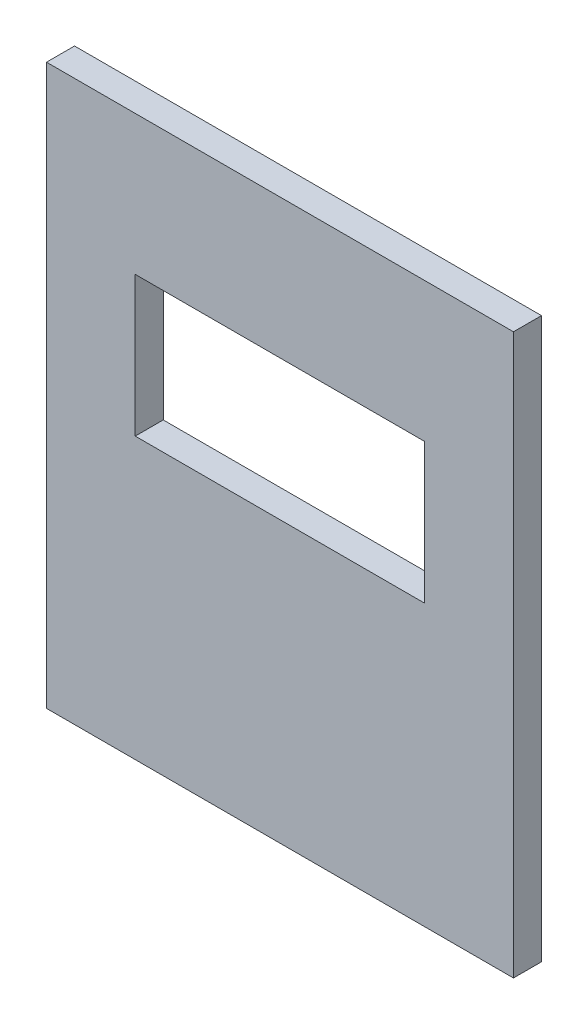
ISO-10303-21;
HEADER;
FILE_DESCRIPTION(('STEP AP214'),'2;1');
FILE_NAME('part.step','',(''),(''),'','','');
FILE_SCHEMA(('AUTOMOTIVE_DESIGN { 1 0 10303 214 1 1 1 1 }'));
ENDSEC;
DATA;
#1=APPLICATION_CONTEXT('core data for automotive mechanical design processes');
#2=APPLICATION_PROTOCOL_DEFINITION('international standard','automotive_design',2000,#1);
#3=PRODUCT_CONTEXT('',#1,'mechanical');
#4=PRODUCT('Part','Part','',(#3));
#5=PRODUCT_RELATED_PRODUCT_CATEGORY('part','',(#4));
#6=PRODUCT_DEFINITION_FORMATION('','',#4);
#7=PRODUCT_DEFINITION_CONTEXT('part definition',#1,'design');
#8=PRODUCT_DEFINITION('design','',#6,#7);
#9=PRODUCT_DEFINITION_SHAPE('','',#8);
#10=(LENGTH_UNIT() NAMED_UNIT(*) SI_UNIT(.MILLI.,.METRE.));
#11=(NAMED_UNIT(*) PLANE_ANGLE_UNIT() SI_UNIT($,.RADIAN.));
#12=(NAMED_UNIT(*) SI_UNIT($,.STERADIAN.) SOLID_ANGLE_UNIT());
#13=UNCERTAINTY_MEASURE_WITH_UNIT(LENGTH_MEASURE(1.E-05),#10,'distance_accuracy_value','');
#14=(GEOMETRIC_REPRESENTATION_CONTEXT(3) GLOBAL_UNCERTAINTY_ASSIGNED_CONTEXT((#13)) GLOBAL_UNIT_ASSIGNED_CONTEXT((#10,
#11,#12)) REPRESENTATION_CONTEXT('',''));
#15=CARTESIAN_POINT('',(0.,0.,0.));
#16=DIRECTION('',(0.,0.,1.));
#17=DIRECTION('',(1.,0.,0.));
#18=AXIS2_PLACEMENT_3D('',#15,#16,#17);
#19=CARTESIAN_POINT('',(0.,0.,3.));
#20=DIRECTION('',(0.,0.,1.));
#21=DIRECTION('',(1.,0.,0.));
#22=AXIS2_PLACEMENT_3D('',#19,#20,#21);
#23=PLANE('',#22);
#24=DIRECTION('',(0.,-1.,0.));
#25=VECTOR('',#24,1.);
#26=CARTESIAN_POINT('',(-33.8238029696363,27.2685185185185,3.));
#27=LINE('',#26,#25);
#28=CARTESIAN_POINT('',(-33.8238029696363,27.2685185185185,3.));
#29=VERTEX_POINT('',#28);
#30=CARTESIAN_POINT('',(-33.8238029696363,-32.6574074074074,3.));
#31=VERTEX_POINT('',#30);
#32=EDGE_CURVE('E133',#29,#31,#27,.T.);
#33=ORIENTED_EDGE('',*,*,#32,.T.);
#34=DIRECTION('',(1.,0.,0.));
#35=VECTOR('',#34,1.);
#36=CARTESIAN_POINT('',(-33.8238029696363,-32.6574074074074,3.));
#37=LINE('',#36,#35);
#38=CARTESIAN_POINT('',(16.1761970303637,-32.6574074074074,3.));
#39=VERTEX_POINT('',#38);
#40=EDGE_CURVE('E136',#31,#39,#37,.T.);
#41=ORIENTED_EDGE('',*,*,#40,.T.);
#42=DIRECTION('',(0.,1.,0.));
#43=VECTOR('',#42,1.);
#44=CARTESIAN_POINT('',(16.1761970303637,27.2685185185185,3.));
#45=LINE('',#44,#43);
#46=CARTESIAN_POINT('',(16.1761970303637,27.2685185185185,3.));
#47=VERTEX_POINT('',#46);
#48=EDGE_CURVE('E139',#39,#47,#45,.T.);
#49=ORIENTED_EDGE('',*,*,#48,.T.);
#50=DIRECTION('',(-1.,0.,0.));
#51=VECTOR('',#50,1.);
#52=CARTESIAN_POINT('',(-33.8238029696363,27.2685185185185,3.));
#53=LINE('',#52,#51);
#54=EDGE_CURVE('E141',#47,#29,#53,.T.);
#55=ORIENTED_EDGE('',*,*,#54,.T.);
#56=EDGE_LOOP('',(#33,#41,#49,#55));
#57=FACE_BOUND('',#56,.T.);
#58=DIRECTION('',(1.,0.,0.));
#59=VECTOR('',#58,1.);
#60=CARTESIAN_POINT('',(-24.3238029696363,-2.65740740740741,3.));
#61=LINE('',#60,#59);
#62=CARTESIAN_POINT('',(-24.3238029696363,-2.65740740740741,3.));
#63=VERTEX_POINT('',#62);
#64=CARTESIAN_POINT('',(6.67619703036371,-2.65740740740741,3.));
#65=VERTEX_POINT('',#64);
#66=EDGE_CURVE('E105',#63,#65,#61,.T.);
#67=ORIENTED_EDGE('',*,*,#66,.F.);
#68=DIRECTION('',(0.,-1.,0.));
#69=VECTOR('',#68,1.);
#70=CARTESIAN_POINT('',(-24.3238029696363,12.3425925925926,3.));
#71=LINE('',#70,#69);
#72=CARTESIAN_POINT('',(-24.3238029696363,12.3425925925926,3.));
#73=VERTEX_POINT('',#72);
#74=EDGE_CURVE('E97',#73,#63,#71,.T.);
#75=ORIENTED_EDGE('',*,*,#74,.F.);
#76=DIRECTION('',(-1.,0.,0.));
#77=VECTOR('',#76,1.);
#78=CARTESIAN_POINT('',(-24.3238029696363,12.3425925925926,3.));
#79=LINE('',#78,#77);
#80=CARTESIAN_POINT('',(6.67619703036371,12.3425925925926,3.));
#81=VERTEX_POINT('',#80);
#82=EDGE_CURVE('E119',#81,#73,#79,.T.);
#83=ORIENTED_EDGE('',*,*,#82,.F.);
#84=DIRECTION('',(0.,1.,0.));
#85=VECTOR('',#84,1.);
#86=CARTESIAN_POINT('',(6.67619703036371,12.3425925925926,3.));
#87=LINE('',#86,#85);
#88=EDGE_CURVE('E117',#65,#81,#87,.T.);
#89=ORIENTED_EDGE('',*,*,#88,.F.);
#90=EDGE_LOOP('',(#67,#75,#83,#89));
#91=FACE_BOUND('',#90,.T.);
#92=ADVANCED_FACE('F32',(#57,#91),#23,.T.);
#93=CARTESIAN_POINT('',(0.,0.,0.));
#94=DIRECTION('',(0.,0.,1.));
#95=DIRECTION('',(1.,0.,0.));
#96=AXIS2_PLACEMENT_3D('',#93,#94,#95);
#97=PLANE('',#96);
#98=DIRECTION('',(0.,-1.,0.));
#99=VECTOR('',#98,1.);
#100=CARTESIAN_POINT('',(-33.8238029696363,27.2685185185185,0.));
#101=LINE('',#100,#99);
#102=CARTESIAN_POINT('',(-33.8238029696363,27.2685185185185,0.));
#103=VERTEX_POINT('',#102);
#104=CARTESIAN_POINT('',(-33.8238029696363,-32.6574074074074,0.));
#105=VERTEX_POINT('',#104);
#106=EDGE_CURVE('E113',#103,#105,#101,.T.);
#107=ORIENTED_EDGE('',*,*,#106,.F.);
#108=DIRECTION('',(-1.,0.,0.));
#109=VECTOR('',#108,1.);
#110=CARTESIAN_POINT('',(-33.8238029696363,27.2685185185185,0.));
#111=LINE('',#110,#109);
#112=CARTESIAN_POINT('',(16.1761970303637,27.2685185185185,0.));
#113=VERTEX_POINT('',#112);
#114=EDGE_CURVE('E137',#113,#103,#111,.T.);
#115=ORIENTED_EDGE('',*,*,#114,.F.);
#116=DIRECTION('',(0.,1.,0.));
#117=VECTOR('',#116,1.);
#118=CARTESIAN_POINT('',(16.1761970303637,27.2685185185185,0.));
#119=LINE('',#118,#117);
#120=CARTESIAN_POINT('',(16.1761970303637,-32.6574074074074,0.));
#121=VERTEX_POINT('',#120);
#122=EDGE_CURVE('E148',#121,#113,#119,.T.);
#123=ORIENTED_EDGE('',*,*,#122,.F.);
#124=DIRECTION('',(1.,0.,0.));
#125=VECTOR('',#124,1.);
#126=CARTESIAN_POINT('',(-33.8238029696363,-32.6574074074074,0.));
#127=LINE('',#126,#125);
#128=EDGE_CURVE('E146',#105,#121,#127,.T.);
#129=ORIENTED_EDGE('',*,*,#128,.F.);
#130=EDGE_LOOP('',(#107,#115,#123,#129));
#131=FACE_BOUND('',#130,.T.);
#132=DIRECTION('',(0.,-1.,0.));
#133=VECTOR('',#132,1.);
#134=CARTESIAN_POINT('',(-24.3238029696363,12.3425925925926,0.));
#135=LINE('',#134,#133);
#136=CARTESIAN_POINT('',(-24.3238029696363,12.3425925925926,0.));
#137=VERTEX_POINT('',#136);
#138=CARTESIAN_POINT('',(-24.3238029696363,-2.65740740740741,0.));
#139=VERTEX_POINT('',#138);
#140=EDGE_CURVE('E55',#137,#139,#135,.T.);
#141=ORIENTED_EDGE('',*,*,#140,.T.);
#142=DIRECTION('',(1.,0.,0.));
#143=VECTOR('',#142,1.);
#144=CARTESIAN_POINT('',(-24.3238029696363,-2.65740740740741,0.));
#145=LINE('',#144,#143);
#146=CARTESIAN_POINT('',(6.67619703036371,-2.65740740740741,0.));
#147=VERTEX_POINT('',#146);
#148=EDGE_CURVE('E112',#139,#147,#145,.T.);
#149=ORIENTED_EDGE('',*,*,#148,.T.);
#150=DIRECTION('',(0.,1.,0.));
#151=VECTOR('',#150,1.);
#152=CARTESIAN_POINT('',(6.67619703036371,12.3425925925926,0.));
#153=LINE('',#152,#151);
#154=CARTESIAN_POINT('',(6.67619703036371,12.3425925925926,0.));
#155=VERTEX_POINT('',#154);
#156=EDGE_CURVE('E125',#147,#155,#153,.T.);
#157=ORIENTED_EDGE('',*,*,#156,.T.);
#158=DIRECTION('',(-1.,0.,0.));
#159=VECTOR('',#158,1.);
#160=CARTESIAN_POINT('',(-24.3238029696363,12.3425925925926,0.));
#161=LINE('',#160,#159);
#162=EDGE_CURVE('E106',#155,#137,#161,.T.);
#163=ORIENTED_EDGE('',*,*,#162,.T.);
#164=EDGE_LOOP('',(#141,#149,#157,#163));
#165=FACE_BOUND('',#164,.T.);
#166=ADVANCED_FACE('F166',(#131,#165),#97,.F.);
#167=CARTESIAN_POINT('',(-33.8238029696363,27.2685185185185,3.));
#168=DIRECTION('',(1.,0.,0.));
#169=DIRECTION('',(0.,0.,-1.));
#170=AXIS2_PLACEMENT_3D('',#167,#168,#169);
#171=PLANE('',#170);
#172=ORIENTED_EDGE('',*,*,#106,.T.);
#173=DIRECTION('',(0.,0.,-1.));
#174=VECTOR('',#173,1.);
#175=CARTESIAN_POINT('',(-33.8238029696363,-32.6574074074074,3.));
#176=LINE('',#175,#174);
#177=EDGE_CURVE('E11',#31,#105,#176,.T.);
#178=ORIENTED_EDGE('',*,*,#177,.F.);
#179=ORIENTED_EDGE('',*,*,#32,.F.);
#180=DIRECTION('',(0.,0.,-1.));
#181=VECTOR('',#180,1.);
#182=CARTESIAN_POINT('',(-33.8238029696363,27.2685185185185,3.));
#183=LINE('',#182,#181);
#184=EDGE_CURVE('E143',#29,#103,#183,.T.);
#185=ORIENTED_EDGE('',*,*,#184,.T.);
#186=EDGE_LOOP('',(#172,#178,#179,#185));
#187=FACE_BOUND('',#186,.T.);
#188=ADVANCED_FACE('F34',(#187),#171,.F.);
#189=CARTESIAN_POINT('',(-33.8238029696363,-32.6574074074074,3.));
#190=DIRECTION('',(0.,1.,0.));
#191=DIRECTION('',(0.,0.,1.));
#192=AXIS2_PLACEMENT_3D('',#189,#190,#191);
#193=PLANE('',#192);
#194=ORIENTED_EDGE('',*,*,#128,.T.);
#195=DIRECTION('',(0.,0.,-1.));
#196=VECTOR('',#195,1.);
#197=CARTESIAN_POINT('',(16.1761970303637,-32.6574074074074,3.));
#198=LINE('',#197,#196);
#199=EDGE_CURVE('E40',#39,#121,#198,.T.);
#200=ORIENTED_EDGE('',*,*,#199,.F.);
#201=ORIENTED_EDGE('',*,*,#40,.F.);
#202=ORIENTED_EDGE('',*,*,#177,.T.);
#203=EDGE_LOOP('',(#194,#200,#201,#202));
#204=FACE_BOUND('',#203,.T.);
#205=ADVANCED_FACE('F176',(#204),#193,.F.);
#206=CARTESIAN_POINT('',(16.1761970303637,27.2685185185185,3.));
#207=DIRECTION('',(-1.,0.,0.));
#208=DIRECTION('',(0.,-1.,0.));
#209=AXIS2_PLACEMENT_3D('',#206,#207,#208);
#210=PLANE('',#209);
#211=ORIENTED_EDGE('',*,*,#122,.T.);
#212=DIRECTION('',(0.,0.,-1.));
#213=VECTOR('',#212,1.);
#214=CARTESIAN_POINT('',(16.1761970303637,27.2685185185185,3.));
#215=LINE('',#214,#213);
#216=EDGE_CURVE('E153',#47,#113,#215,.T.);
#217=ORIENTED_EDGE('',*,*,#216,.F.);
#218=ORIENTED_EDGE('',*,*,#48,.F.);
#219=ORIENTED_EDGE('',*,*,#199,.T.);
#220=EDGE_LOOP('',(#211,#217,#218,#219));
#221=FACE_BOUND('',#220,.T.);
#222=ADVANCED_FACE('F160',(#221),#210,.F.);
#223=CARTESIAN_POINT('',(-33.8238029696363,27.2685185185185,3.));
#224=DIRECTION('',(0.,-1.,0.));
#225=DIRECTION('',(0.,0.,-1.));
#226=AXIS2_PLACEMENT_3D('',#223,#224,#225);
#227=PLANE('',#226);
#228=ORIENTED_EDGE('',*,*,#114,.T.);
#229=ORIENTED_EDGE('',*,*,#184,.F.);
#230=ORIENTED_EDGE('',*,*,#54,.F.);
#231=ORIENTED_EDGE('',*,*,#216,.T.);
#232=EDGE_LOOP('',(#228,#229,#230,#231));
#233=FACE_BOUND('',#232,.T.);
#234=ADVANCED_FACE('F170',(#233),#227,.F.);
#235=CARTESIAN_POINT('',(-24.3238029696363,12.3425925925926,3.));
#236=DIRECTION('',(1.,0.,0.));
#237=DIRECTION('',(0.,1.,0.));
#238=AXIS2_PLACEMENT_3D('',#235,#236,#237);
#239=PLANE('',#238);
#240=ORIENTED_EDGE('',*,*,#140,.F.);
#241=DIRECTION('',(0.,0.,-1.));
#242=VECTOR('',#241,1.);
#243=CARTESIAN_POINT('',(-24.3238029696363,12.3425925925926,3.));
#244=LINE('',#243,#242);
#245=EDGE_CURVE('E101',#73,#137,#244,.T.);
#246=ORIENTED_EDGE('',*,*,#245,.F.);
#247=ORIENTED_EDGE('',*,*,#74,.T.);
#248=DIRECTION('',(0.,0.,-1.));
#249=VECTOR('',#248,1.);
#250=CARTESIAN_POINT('',(-24.3238029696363,-2.65740740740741,3.));
#251=LINE('',#250,#249);
#252=EDGE_CURVE('E100',#63,#139,#251,.T.);
#253=ORIENTED_EDGE('',*,*,#252,.T.);
#254=EDGE_LOOP('',(#240,#246,#247,#253));
#255=FACE_BOUND('',#254,.T.);
#256=ADVANCED_FACE('F99',(#255),#239,.T.);
#257=CARTESIAN_POINT('',(-24.3238029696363,-2.65740740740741,3.));
#258=DIRECTION('',(0.,1.,0.));
#259=DIRECTION('',(0.,0.,1.));
#260=AXIS2_PLACEMENT_3D('',#257,#258,#259);
#261=PLANE('',#260);
#262=ORIENTED_EDGE('',*,*,#148,.F.);
#263=ORIENTED_EDGE('',*,*,#252,.F.);
#264=ORIENTED_EDGE('',*,*,#66,.T.);
#265=DIRECTION('',(0.,0.,-1.));
#266=VECTOR('',#265,1.);
#267=CARTESIAN_POINT('',(6.67619703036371,-2.65740740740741,3.));
#268=LINE('',#267,#266);
#269=EDGE_CURVE('E114',#65,#147,#268,.T.);
#270=ORIENTED_EDGE('',*,*,#269,.T.);
#271=EDGE_LOOP('',(#262,#263,#264,#270));
#272=FACE_BOUND('',#271,.T.);
#273=ADVANCED_FACE('F109',(#272),#261,.T.);
#274=CARTESIAN_POINT('',(6.67619703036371,12.3425925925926,3.));
#275=DIRECTION('',(-1.,0.,0.));
#276=DIRECTION('',(0.,-1.,0.));
#277=AXIS2_PLACEMENT_3D('',#274,#275,#276);
#278=PLANE('',#277);
#279=ORIENTED_EDGE('',*,*,#156,.F.);
#280=ORIENTED_EDGE('',*,*,#269,.F.);
#281=ORIENTED_EDGE('',*,*,#88,.T.);
#282=DIRECTION('',(0.,0.,-1.));
#283=VECTOR('',#282,1.);
#284=CARTESIAN_POINT('',(6.67619703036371,12.3425925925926,3.));
#285=LINE('',#284,#283);
#286=EDGE_CURVE('E47',#81,#155,#285,.T.);
#287=ORIENTED_EDGE('',*,*,#286,.T.);
#288=EDGE_LOOP('',(#279,#280,#281,#287));
#289=FACE_BOUND('',#288,.T.);
#290=ADVANCED_FACE('F200',(#289),#278,.T.);
#291=CARTESIAN_POINT('',(-24.3238029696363,12.3425925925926,3.));
#292=DIRECTION('',(0.,-1.,0.));
#293=DIRECTION('',(0.,0.,-1.));
#294=AXIS2_PLACEMENT_3D('',#291,#292,#293);
#295=PLANE('',#294);
#296=ORIENTED_EDGE('',*,*,#162,.F.);
#297=ORIENTED_EDGE('',*,*,#286,.F.);
#298=ORIENTED_EDGE('',*,*,#82,.T.);
#299=ORIENTED_EDGE('',*,*,#245,.T.);
#300=EDGE_LOOP('',(#296,#297,#298,#299));
#301=FACE_BOUND('',#300,.T.);
#302=ADVANCED_FACE('F203',(#301),#295,.T.);
#303=CLOSED_SHELL('',(#92,#166,#188,#205,#222,#234,#256,#273,#290,#302));
#304=MANIFOLD_SOLID_BREP('B2',#303);
#305=ADVANCED_BREP_SHAPE_REPRESENTATION('',(#18,#304),#14);
#306=SHAPE_DEFINITION_REPRESENTATION(#9,#305);
ENDSEC;
END-ISO-10303-21;
